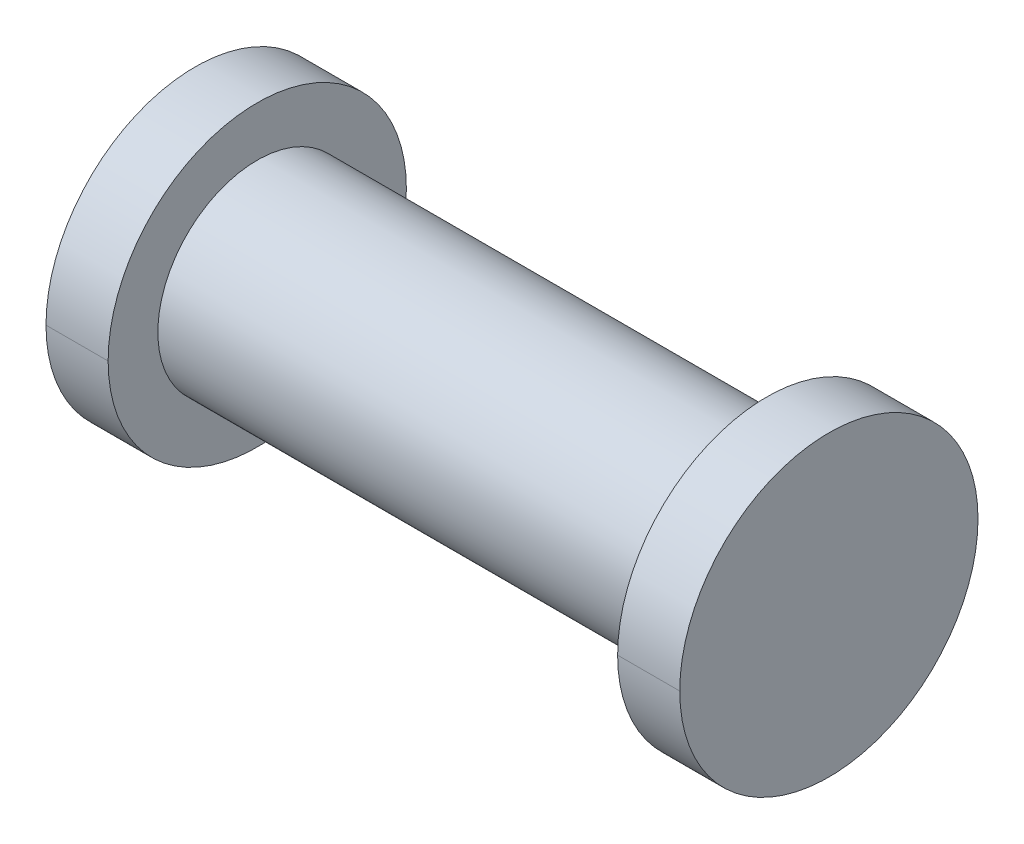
ISO-10303-21;
HEADER;
FILE_DESCRIPTION(('STEP AP214'),'2;1');
FILE_NAME('part.step','',(''),(''),'','','');
FILE_SCHEMA(('AUTOMOTIVE_DESIGN { 1 0 10303 214 1 1 1 1 }'));
ENDSEC;
DATA;
#1=APPLICATION_CONTEXT('core data for automotive mechanical design processes');
#2=APPLICATION_PROTOCOL_DEFINITION('international standard','automotive_design',2000,#1);
#3=PRODUCT_CONTEXT('',#1,'mechanical');
#4=PRODUCT('Part','Part','',(#3));
#5=PRODUCT_RELATED_PRODUCT_CATEGORY('part','',(#4));
#6=PRODUCT_DEFINITION_FORMATION('','',#4);
#7=PRODUCT_DEFINITION_CONTEXT('part definition',#1,'design');
#8=PRODUCT_DEFINITION('design','',#6,#7);
#9=PRODUCT_DEFINITION_SHAPE('','',#8);
#10=(LENGTH_UNIT() NAMED_UNIT(*) SI_UNIT(.MILLI.,.METRE.));
#11=(NAMED_UNIT(*) PLANE_ANGLE_UNIT() SI_UNIT($,.RADIAN.));
#12=(NAMED_UNIT(*) SI_UNIT($,.STERADIAN.) SOLID_ANGLE_UNIT());
#13=UNCERTAINTY_MEASURE_WITH_UNIT(LENGTH_MEASURE(1.E-05),#10,'distance_accuracy_value','');
#14=(GEOMETRIC_REPRESENTATION_CONTEXT(3) GLOBAL_UNCERTAINTY_ASSIGNED_CONTEXT((#13)) GLOBAL_UNIT_ASSIGNED_CONTEXT((#10,
#11,#12)) REPRESENTATION_CONTEXT('',''));
#15=CARTESIAN_POINT('',(0.,0.,0.));
#16=DIRECTION('',(0.,0.,1.));
#17=DIRECTION('',(1.,0.,0.));
#18=AXIS2_PLACEMENT_3D('',#15,#16,#17);
#19=CARTESIAN_POINT('',(0.,0.,0.));
#20=DIRECTION('',(1.,0.,0.));
#21=DIRECTION('',(0.,0.,-1.));
#22=AXIS2_PLACEMENT_3D('',#19,#20,#21);
#23=CYLINDRICAL_SURFACE('',#22,12.);
#24=CARTESIAN_POINT('',(-51.,0.,0.));
#25=DIRECTION('',(1.,0.,0.));
#26=DIRECTION('',(0.,0.,-1.));
#27=AXIS2_PLACEMENT_3D('',#24,#25,#26);
#28=CIRCLE('',#27,12.);
#29=CARTESIAN_POINT('',(-51.,0.,12.));
#30=VERTEX_POINT('',#29);
#31=CARTESIAN_POINT('',(-51.,0.,-12.));
#32=VERTEX_POINT('',#31);
#33=EDGE_CURVE('E104',#30,#32,#28,.T.);
#34=ORIENTED_EDGE('',*,*,#33,.T.);
#35=DIRECTION('',(1.,0.,0.));
#36=VECTOR('',#35,1.);
#37=CARTESIAN_POINT('',(0.,0.,-12.));
#38=LINE('',#37,#36);
#39=CARTESIAN_POINT('',(-46.,0.,-12.));
#40=VERTEX_POINT('',#39);
#41=EDGE_CURVE('E12',#32,#40,#38,.T.);
#42=ORIENTED_EDGE('',*,*,#41,.T.);
#43=CARTESIAN_POINT('',(-46.,0.,0.));
#44=DIRECTION('',(1.,0.,0.));
#45=DIRECTION('',(0.,0.,-1.));
#46=AXIS2_PLACEMENT_3D('',#43,#44,#45);
#47=CIRCLE('',#46,12.);
#48=CARTESIAN_POINT('',(-46.,0.,12.));
#49=VERTEX_POINT('',#48);
#50=EDGE_CURVE('E106',#49,#40,#47,.T.);
#51=ORIENTED_EDGE('',*,*,#50,.F.);
#52=DIRECTION('',(-1.,0.,0.));
#53=VECTOR('',#52,1.);
#54=CARTESIAN_POINT('',(0.,0.,12.));
#55=LINE('',#54,#53);
#56=EDGE_CURVE('E47',#49,#30,#55,.T.);
#57=ORIENTED_EDGE('',*,*,#56,.T.);
#58=EDGE_LOOP('',(#34,#42,#51,#57));
#59=FACE_BOUND('',#58,.T.);
#60=ADVANCED_FACE('F39',(#59),#23,.T.);
#61=CARTESIAN_POINT('',(0.,0.,0.));
#62=DIRECTION('',(1.,0.,0.));
#63=DIRECTION('',(0.,0.,-1.));
#64=AXIS2_PLACEMENT_3D('',#61,#62,#63);
#65=CYLINDRICAL_SURFACE('',#64,12.);
#66=CARTESIAN_POINT('',(-5.,0.,0.));
#67=DIRECTION('',(1.,0.,0.));
#68=DIRECTION('',(0.,0.,-1.));
#69=AXIS2_PLACEMENT_3D('',#66,#67,#68);
#70=CIRCLE('',#69,12.);
#71=CARTESIAN_POINT('',(-5.,0.,12.));
#72=VERTEX_POINT('',#71);
#73=CARTESIAN_POINT('',(-5.,0.,-12.));
#74=VERTEX_POINT('',#73);
#75=EDGE_CURVE('E87',#72,#74,#70,.T.);
#76=ORIENTED_EDGE('',*,*,#75,.T.);
#77=DIRECTION('',(1.,0.,0.));
#78=VECTOR('',#77,1.);
#79=CARTESIAN_POINT('',(0.,0.,-12.));
#80=LINE('',#79,#78);
#81=CARTESIAN_POINT('',(0.,0.,-12.));
#82=VERTEX_POINT('',#81);
#83=EDGE_CURVE('E83',#74,#82,#80,.T.);
#84=ORIENTED_EDGE('',*,*,#83,.T.);
#85=CARTESIAN_POINT('',(0.,0.,0.));
#86=DIRECTION('',(1.,0.,0.));
#87=DIRECTION('',(0.,0.,-1.));
#88=AXIS2_PLACEMENT_3D('',#85,#86,#87);
#89=CIRCLE('',#88,12.);
#90=CARTESIAN_POINT('',(0.,0.,12.));
#91=VERTEX_POINT('',#90);
#92=EDGE_CURVE('E93',#91,#82,#89,.T.);
#93=ORIENTED_EDGE('',*,*,#92,.F.);
#94=DIRECTION('',(-1.,0.,0.));
#95=VECTOR('',#94,1.);
#96=CARTESIAN_POINT('',(0.,0.,12.));
#97=LINE('',#96,#95);
#98=EDGE_CURVE('E81',#91,#72,#97,.T.);
#99=ORIENTED_EDGE('',*,*,#98,.T.);
#100=EDGE_LOOP('',(#76,#84,#93,#99));
#101=FACE_BOUND('',#100,.T.);
#102=ADVANCED_FACE('F91',(#101),#65,.T.);
#103=CARTESIAN_POINT('',(0.,0.,0.));
#104=DIRECTION('',(1.,0.,0.));
#105=DIRECTION('',(0.,0.,-1.));
#106=AXIS2_PLACEMENT_3D('',#103,#104,#105);
#107=PLANE('',#106);
#108=ORIENTED_EDGE('',*,*,#92,.T.);
#109=EDGE_CURVE('E96',#82,#91,#89,.T.);
#110=ORIENTED_EDGE('',*,*,#109,.T.);
#111=EDGE_LOOP('',(#108,#110));
#112=FACE_BOUND('',#111,.T.);
#113=ADVANCED_FACE('F41',(#112),#107,.T.);
#114=ORIENTED_EDGE('',*,*,#83,.F.);
#115=EDGE_CURVE('E77',#74,#72,#70,.T.);
#116=ORIENTED_EDGE('',*,*,#115,.T.);
#117=ORIENTED_EDGE('',*,*,#98,.F.);
#118=ORIENTED_EDGE('',*,*,#109,.F.);
#119=EDGE_LOOP('',(#114,#116,#117,#118));
#120=FACE_BOUND('',#119,.T.);
#121=ADVANCED_FACE('F79',(#120),#65,.T.);
#122=CARTESIAN_POINT('',(-5.,0.,-12.));
#123=DIRECTION('',(-1.,0.,0.));
#124=DIRECTION('',(0.,0.,1.));
#125=AXIS2_PLACEMENT_3D('',#122,#123,#124);
#126=PLANE('',#125);
#127=CARTESIAN_POINT('',(-5.,0.,0.));
#128=DIRECTION('',(1.,0.,0.));
#129=DIRECTION('',(0.,0.,-1.));
#130=AXIS2_PLACEMENT_3D('',#127,#128,#129);
#131=CIRCLE('',#130,8.);
#132=CARTESIAN_POINT('',(-5.,0.,-8.));
#133=VERTEX_POINT('',#132);
#134=EDGE_CURVE('E88',#133,#133,#131,.T.);
#135=ORIENTED_EDGE('',*,*,#134,.T.);
#136=EDGE_LOOP('',(#135));
#137=FACE_BOUND('',#136,.T.);
#138=ORIENTED_EDGE('',*,*,#75,.F.);
#139=ORIENTED_EDGE('',*,*,#115,.F.);
#140=EDGE_LOOP('',(#138,#139));
#141=FACE_BOUND('',#140,.T.);
#142=ADVANCED_FACE('F95',(#137,#141),#126,.T.);
#143=CARTESIAN_POINT('',(0.,0.,0.));
#144=DIRECTION('',(1.,0.,0.));
#145=DIRECTION('',(0.,0.,-1.));
#146=AXIS2_PLACEMENT_3D('',#143,#144,#145);
#147=CYLINDRICAL_SURFACE('',#146,8.);
#148=CARTESIAN_POINT('',(-46.,0.,0.));
#149=DIRECTION('',(1.,0.,0.));
#150=DIRECTION('',(0.,0.,-1.));
#151=AXIS2_PLACEMENT_3D('',#148,#149,#150);
#152=CIRCLE('',#151,8.);
#153=CARTESIAN_POINT('',(-46.,0.,-8.));
#154=VERTEX_POINT('',#153);
#155=EDGE_CURVE('E113',#154,#154,#152,.T.);
#156=ORIENTED_EDGE('',*,*,#155,.T.);
#157=EDGE_LOOP('',(#156));
#158=FACE_BOUND('',#157,.T.);
#159=ORIENTED_EDGE('',*,*,#134,.F.);
#160=EDGE_LOOP('',(#159));
#161=FACE_BOUND('',#160,.T.);
#162=ADVANCED_FACE('F121',(#158,#161),#147,.T.);
#163=CARTESIAN_POINT('',(-46.,0.,-8.));
#164=DIRECTION('',(1.,0.,0.));
#165=DIRECTION('',(0.,0.,-1.));
#166=AXIS2_PLACEMENT_3D('',#163,#164,#165);
#167=PLANE('',#166);
#168=ORIENTED_EDGE('',*,*,#50,.T.);
#169=EDGE_CURVE('E110',#40,#49,#47,.T.);
#170=ORIENTED_EDGE('',*,*,#169,.T.);
#171=EDGE_LOOP('',(#168,#170));
#172=FACE_BOUND('',#171,.T.);
#173=ORIENTED_EDGE('',*,*,#155,.F.);
#174=EDGE_LOOP('',(#173));
#175=FACE_BOUND('',#174,.T.);
#176=ADVANCED_FACE('F123',(#172,#175),#167,.T.);
#177=ORIENTED_EDGE('',*,*,#41,.F.);
#178=EDGE_CURVE('E109',#32,#30,#28,.T.);
#179=ORIENTED_EDGE('',*,*,#178,.T.);
#180=ORIENTED_EDGE('',*,*,#56,.F.);
#181=ORIENTED_EDGE('',*,*,#169,.F.);
#182=EDGE_LOOP('',(#177,#179,#180,#181));
#183=FACE_BOUND('',#182,.T.);
#184=ADVANCED_FACE('F129',(#183),#23,.T.);
#185=CARTESIAN_POINT('',(-51.,0.,-12.));
#186=DIRECTION('',(-1.,0.,0.));
#187=DIRECTION('',(0.,0.,1.));
#188=AXIS2_PLACEMENT_3D('',#185,#186,#187);
#189=PLANE('',#188);
#190=ORIENTED_EDGE('',*,*,#33,.F.);
#191=ORIENTED_EDGE('',*,*,#178,.F.);
#192=EDGE_LOOP('',(#190,#191));
#193=FACE_BOUND('',#192,.T.);
#194=ADVANCED_FACE('F108',(#193),#189,.T.);
#195=CLOSED_SHELL('',(#60,#102,#113,#121,#142,#162,#176,#184,#194));
#196=MANIFOLD_SOLID_BREP('B2',#195);
#197=ADVANCED_BREP_SHAPE_REPRESENTATION('',(#18,#196),#14);
#198=SHAPE_DEFINITION_REPRESENTATION(#9,#197);
ENDSEC;
END-ISO-10303-21;
